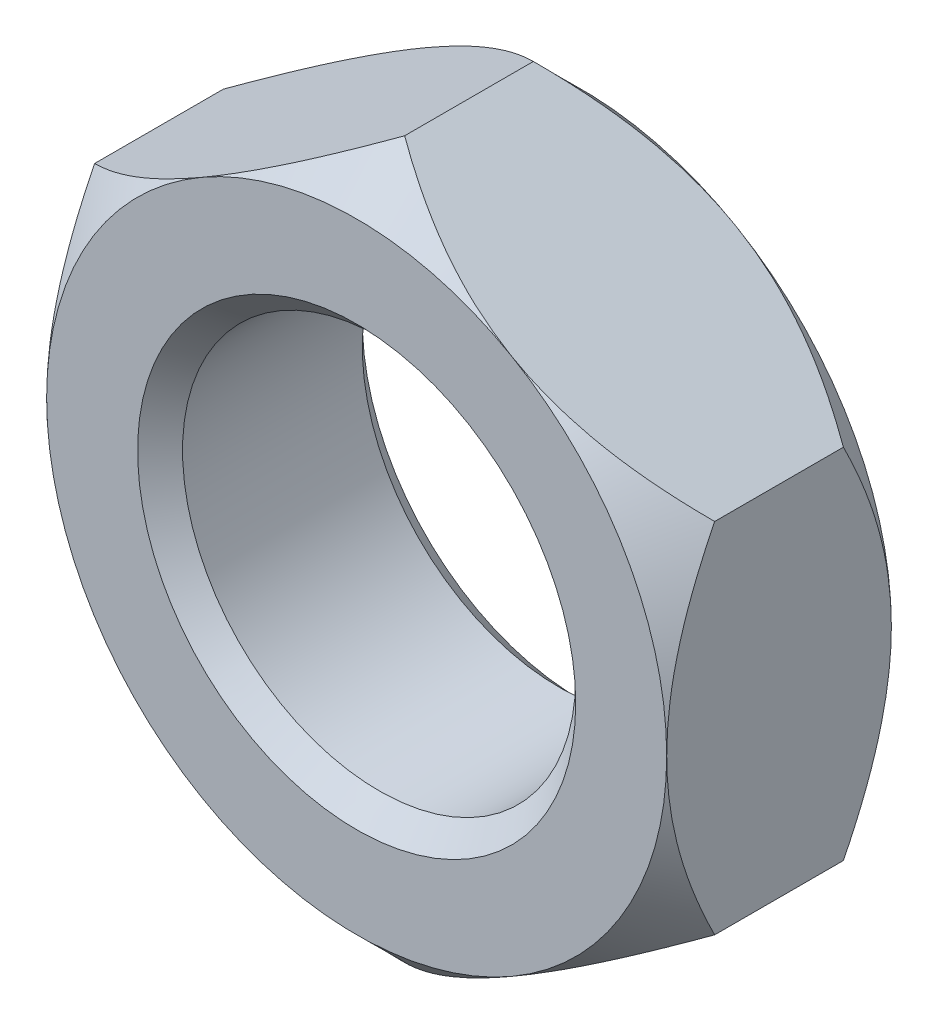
from build123d import *

# Parameters (mm, degrees)
BASE_EXTRUDE_DEPTH = 3.175
SKETCH4_R          = 5.55625
CUT_EXTRUDE1_DEPTH = 15.815517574
CHAMFER1_SIZE      = 0.635
CHAMFER2_SIZE      = 0.635


with BuildPart() as part:
    # Sketch1 → Base-Extrude (new, symmetric)
    with BuildSketch(Plane.XY):
        Polygon((0, 10.118640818), (8.763, 5.059320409), (8.763, -5.059320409), (0, -10.118640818), (-8.763, -5.059320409), (-8.763, 5.059320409), align=None)
    extrude(amount=BASE_EXTRUDE_DEPTH, both=True)

    # Sketch3 → Cut-Revolve1 (revolve, cut)
    with BuildSketch(Plane(origin=(0, 0, 0), x_dir=(0, 0, -1), z_dir=(1, 0, 0))):
        Polygon((-1.819359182, 10.118640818), (-3.175, 10.118640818), (-3.175, 8.763), align=None)
    revolve(axis=Axis((0, 0, 5.006749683), (0, 0, -1)), mode=Mode.SUBTRACT)

    # Sketch6 → Cut-Revolve3 (revolve, cut)
    with BuildSketch(Plane(origin=(0, 0, 0), x_dir=(0, 0, -1), z_dir=(1, 0, 0))):
        Polygon((1.819359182, 10.118640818), (3.175, 10.118640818), (3.175, 8.763), align=None)
    revolve(axis=Axis((0, 0, 0), (0, 0, -1)), mode=Mode.SUBTRACT)

    # Sketch4 → Cut-Extrude1 (cut, through all)
    with BuildSketch(Plane.XY.offset(3.175)):
        Circle(SKETCH4_R)
    extrude(amount=-CUT_EXTRUDE1_DEPTH, mode=Mode.SUBTRACT)

    # Chamfer1
    chamfer1_edges = [part.edges().sort_by_distance(p)[0] for p in [
        (-5.55625, 0, 3.175),
    ]]
    chamfer(chamfer1_edges, length=CHAMFER1_SIZE)

    # Chamfer2
    chamfer2_edges = [part.edges().sort_by_distance(p)[0] for p in [
        (-5.55625, 0, -3.175),
    ]]
    chamfer(chamfer2_edges, length=CHAMFER2_SIZE)


solid = part.part
